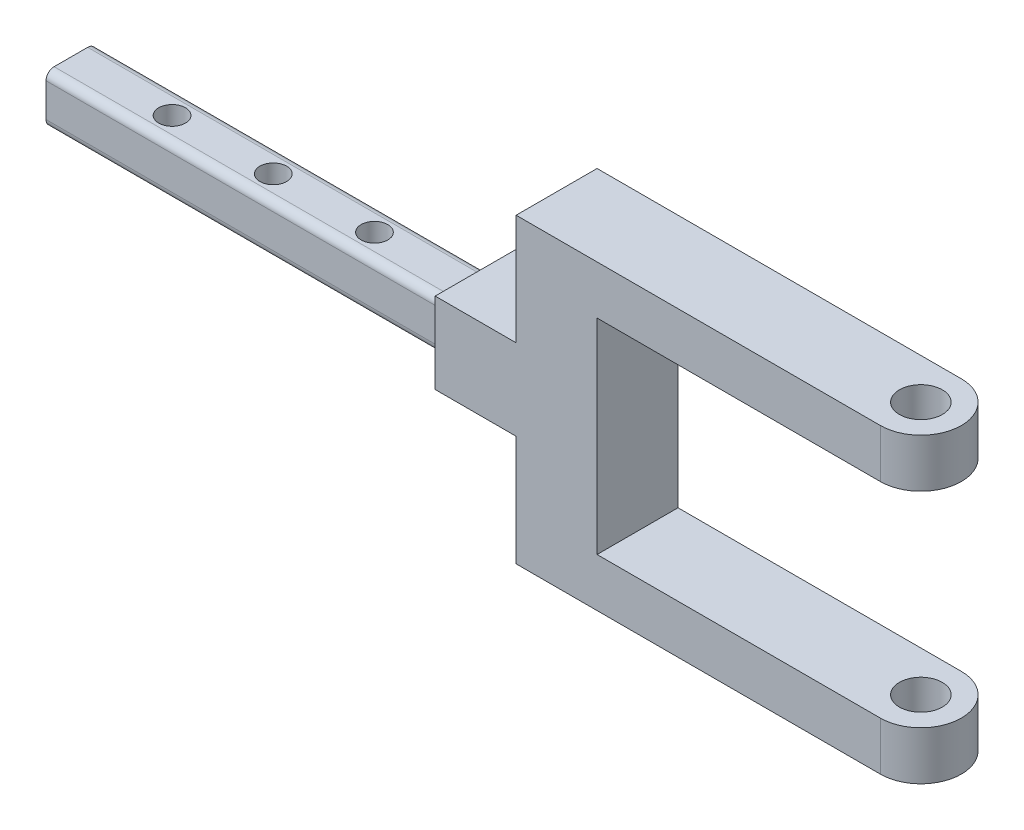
ISO-10303-21;
HEADER;
FILE_DESCRIPTION(('STEP AP214'),'2;1');
FILE_NAME('part.step','',(''),(''),'','','');
FILE_SCHEMA(('AUTOMOTIVE_DESIGN { 1 0 10303 214 1 1 1 1 }'));
ENDSEC;
DATA;
#1=APPLICATION_CONTEXT('core data for automotive mechanical design processes');
#2=APPLICATION_PROTOCOL_DEFINITION('international standard','automotive_design',2000,#1);
#3=PRODUCT_CONTEXT('',#1,'mechanical');
#4=PRODUCT('Part','Part','',(#3));
#5=PRODUCT_RELATED_PRODUCT_CATEGORY('part','',(#4));
#6=PRODUCT_DEFINITION_FORMATION('','',#4);
#7=PRODUCT_DEFINITION_CONTEXT('part definition',#1,'design');
#8=PRODUCT_DEFINITION('design','',#6,#7);
#9=PRODUCT_DEFINITION_SHAPE('','',#8);
#10=(LENGTH_UNIT() NAMED_UNIT(*) SI_UNIT(.MILLI.,.METRE.));
#11=(NAMED_UNIT(*) PLANE_ANGLE_UNIT() SI_UNIT($,.RADIAN.));
#12=(NAMED_UNIT(*) SI_UNIT($,.STERADIAN.) SOLID_ANGLE_UNIT());
#13=UNCERTAINTY_MEASURE_WITH_UNIT(LENGTH_MEASURE(1.E-05),#10,'distance_accuracy_value','');
#14=(GEOMETRIC_REPRESENTATION_CONTEXT(3) GLOBAL_UNCERTAINTY_ASSIGNED_CONTEXT((#13)) GLOBAL_UNIT_ASSIGNED_CONTEXT((#10,
#11,#12)) REPRESENTATION_CONTEXT('',''));
#15=CARTESIAN_POINT('',(0.,0.,0.));
#16=DIRECTION('',(0.,0.,1.));
#17=DIRECTION('',(1.,0.,0.));
#18=AXIS2_PLACEMENT_3D('',#15,#16,#17);
#19=CARTESIAN_POINT('',(40.,18.65,10.));
#20=DIRECTION('',(0.,-1.,0.));
#21=DIRECTION('',(1.,0.,0.));
#22=AXIS2_PLACEMENT_3D('',#19,#20,#21);
#23=PLANE('',#22);
#24=CARTESIAN_POINT('',(35.,18.65,5.));
#25=DIRECTION('',(0.,1.,0.));
#26=DIRECTION('',(-1.,0.,0.));
#27=AXIS2_PLACEMENT_3D('',#24,#25,#26);
#28=CIRCLE('',#27,2.65);
#29=CARTESIAN_POINT('',(32.35,18.65,5.));
#30=VERTEX_POINT('',#29);
#31=EDGE_CURVE('E416',#30,#30,#28,.T.);
#32=ORIENTED_EDGE('',*,*,#31,.F.);
#33=EDGE_LOOP('',(#32));
#34=FACE_BOUND('',#33,.T.);
#35=DIRECTION('',(-1.,0.,0.));
#36=VECTOR('',#35,1.);
#37=CARTESIAN_POINT('',(40.,18.65,10.));
#38=LINE('',#37,#36);
#39=CARTESIAN_POINT('',(35.,18.65,10.));
#40=VERTEX_POINT('',#39);
#41=CARTESIAN_POINT('',(-10.,18.65,10.));
#42=VERTEX_POINT('',#41);
#43=EDGE_CURVE('E269',#40,#42,#38,.T.);
#44=ORIENTED_EDGE('',*,*,#43,.F.);
#45=CARTESIAN_POINT('',(35.,18.65,5.));
#46=DIRECTION('',(0.,1.,0.));
#47=DIRECTION('',(-1.,0.,0.));
#48=AXIS2_PLACEMENT_3D('',#45,#46,#47);
#49=CIRCLE('',#48,5.);
#50=CARTESIAN_POINT('',(35.,18.65,0.));
#51=VERTEX_POINT('',#50);
#52=EDGE_CURVE('E226',#40,#51,#49,.T.);
#53=ORIENTED_EDGE('',*,*,#52,.T.);
#54=DIRECTION('',(-1.,0.,0.));
#55=VECTOR('',#54,1.);
#56=CARTESIAN_POINT('',(40.,18.65,0.));
#57=LINE('',#56,#55);
#58=CARTESIAN_POINT('',(-10.,18.65,0.));
#59=VERTEX_POINT('',#58);
#60=EDGE_CURVE('E255',#51,#59,#57,.T.);
#61=ORIENTED_EDGE('',*,*,#60,.T.);
#62=DIRECTION('',(0.,0.,-1.));
#63=VECTOR('',#62,1.);
#64=CARTESIAN_POINT('',(-10.,18.65,10.));
#65=LINE('',#64,#63);
#66=EDGE_CURVE('E277',#42,#59,#65,.T.);
#67=ORIENTED_EDGE('',*,*,#66,.F.);
#68=EDGE_LOOP('',(#44,#53,#61,#67));
#69=FACE_BOUND('',#68,.T.);
#70=ADVANCED_FACE('F79',(#34,#69),#23,.F.);
#71=CARTESIAN_POINT('',(-10.,-18.65,10.));
#72=DIRECTION('',(0.,1.,0.));
#73=DIRECTION('',(-1.,0.,0.));
#74=AXIS2_PLACEMENT_3D('',#71,#72,#73);
#75=PLANE('',#74);
#76=CARTESIAN_POINT('',(35.,-18.65,5.));
#77=DIRECTION('',(0.,1.,0.));
#78=DIRECTION('',(-1.,0.,0.));
#79=AXIS2_PLACEMENT_3D('',#76,#77,#78);
#80=CIRCLE('',#79,2.65);
#81=CARTESIAN_POINT('',(32.35,-18.65,5.));
#82=VERTEX_POINT('',#81);
#83=EDGE_CURVE('E419',#82,#82,#80,.T.);
#84=ORIENTED_EDGE('',*,*,#83,.T.);
#85=EDGE_LOOP('',(#84));
#86=FACE_BOUND('',#85,.T.);
#87=CARTESIAN_POINT('',(35.,-18.65,5.));
#88=DIRECTION('',(0.,1.,0.));
#89=DIRECTION('',(-1.,0.,0.));
#90=AXIS2_PLACEMENT_3D('',#87,#88,#89);
#91=CIRCLE('',#90,5.);
#92=CARTESIAN_POINT('',(35.,-18.65,10.));
#93=VERTEX_POINT('',#92);
#94=CARTESIAN_POINT('',(35.,-18.65,0.));
#95=VERTEX_POINT('',#94);
#96=EDGE_CURVE('E215',#93,#95,#91,.T.);
#97=ORIENTED_EDGE('',*,*,#96,.F.);
#98=DIRECTION('',(1.,0.,0.));
#99=VECTOR('',#98,1.);
#100=CARTESIAN_POINT('',(-10.,-18.65,10.));
#101=LINE('',#100,#99);
#102=CARTESIAN_POINT('',(-10.,-18.65,10.));
#103=VERTEX_POINT('',#102);
#104=EDGE_CURVE('E220',#103,#93,#101,.T.);
#105=ORIENTED_EDGE('',*,*,#104,.F.);
#106=DIRECTION('',(0.,0.,-1.));
#107=VECTOR('',#106,1.);
#108=CARTESIAN_POINT('',(-10.,-18.65,10.));
#109=LINE('',#108,#107);
#110=CARTESIAN_POINT('',(-10.,-18.65,0.));
#111=VERTEX_POINT('',#110);
#112=EDGE_CURVE('E275',#103,#111,#109,.T.);
#113=ORIENTED_EDGE('',*,*,#112,.T.);
#114=DIRECTION('',(1.,0.,0.));
#115=VECTOR('',#114,1.);
#116=CARTESIAN_POINT('',(-10.,-18.65,0.));
#117=LINE('',#116,#115);
#118=EDGE_CURVE('E222',#111,#95,#117,.T.);
#119=ORIENTED_EDGE('',*,*,#118,.T.);
#120=EDGE_LOOP('',(#97,#105,#113,#119));
#121=FACE_BOUND('',#120,.T.);
#122=ADVANCED_FACE('F217',(#86,#121),#75,.F.);
#123=CARTESIAN_POINT('',(40.,-12.65,10.));
#124=DIRECTION('',(0.,-1.,0.));
#125=DIRECTION('',(1.,0.,0.));
#126=AXIS2_PLACEMENT_3D('',#123,#124,#125);
#127=PLANE('',#126);
#128=CARTESIAN_POINT('',(35.,-12.65,5.));
#129=DIRECTION('',(0.,-1.,0.));
#130=DIRECTION('',(1.,0.,0.));
#131=AXIS2_PLACEMENT_3D('',#128,#129,#130);
#132=CIRCLE('',#131,2.65);
#133=CARTESIAN_POINT('',(37.65,-12.65,5.));
#134=VERTEX_POINT('',#133);
#135=EDGE_CURVE('E286',#134,#134,#132,.T.);
#136=ORIENTED_EDGE('',*,*,#135,.T.);
#137=EDGE_LOOP('',(#136));
#138=FACE_BOUND('',#137,.T.);
#139=DIRECTION('',(-1.,0.,0.));
#140=VECTOR('',#139,1.);
#141=CARTESIAN_POINT('',(40.,-12.65,10.));
#142=LINE('',#141,#140);
#143=CARTESIAN_POINT('',(35.,-12.65,10.));
#144=VERTEX_POINT('',#143);
#145=CARTESIAN_POINT('',(0.,-12.65,10.));
#146=VERTEX_POINT('',#145);
#147=EDGE_CURVE('E241',#144,#146,#142,.T.);
#148=ORIENTED_EDGE('',*,*,#147,.F.);
#149=CARTESIAN_POINT('',(35.,-12.65,5.));
#150=DIRECTION('',(0.,-1.,0.));
#151=DIRECTION('',(1.,0.,0.));
#152=AXIS2_PLACEMENT_3D('',#149,#150,#151);
#153=CIRCLE('',#152,5.);
#154=CARTESIAN_POINT('',(35.,-12.65,0.));
#155=VERTEX_POINT('',#154);
#156=EDGE_CURVE('E232',#155,#144,#153,.T.);
#157=ORIENTED_EDGE('',*,*,#156,.F.);
#158=DIRECTION('',(-1.,0.,0.));
#159=VECTOR('',#158,1.);
#160=CARTESIAN_POINT('',(40.,-12.65,0.));
#161=LINE('',#160,#159);
#162=CARTESIAN_POINT('',(0.,-12.65,0.));
#163=VERTEX_POINT('',#162);
#164=EDGE_CURVE('E262',#155,#163,#161,.T.);
#165=ORIENTED_EDGE('',*,*,#164,.T.);
#166=DIRECTION('',(0.,0.,-1.));
#167=VECTOR('',#166,1.);
#168=CARTESIAN_POINT('',(0.,-12.65,10.));
#169=LINE('',#168,#167);
#170=EDGE_CURVE('E272',#146,#163,#169,.T.);
#171=ORIENTED_EDGE('',*,*,#170,.F.);
#172=EDGE_LOOP('',(#148,#157,#165,#171));
#173=FACE_BOUND('',#172,.T.);
#174=ADVANCED_FACE('F430',(#138,#173),#127,.F.);
#175=CARTESIAN_POINT('',(0.,12.65,10.));
#176=DIRECTION('',(0.,1.,0.));
#177=DIRECTION('',(0.,0.,1.));
#178=AXIS2_PLACEMENT_3D('',#175,#176,#177);
#179=PLANE('',#178);
#180=CARTESIAN_POINT('',(35.,12.65,5.));
#181=DIRECTION('',(0.,1.,0.));
#182=DIRECTION('',(0.,0.,1.));
#183=AXIS2_PLACEMENT_3D('',#180,#181,#182);
#184=CIRCLE('',#183,2.65);
#185=CARTESIAN_POINT('',(35.,12.65,7.65));
#186=VERTEX_POINT('',#185);
#187=EDGE_CURVE('E283',#186,#186,#184,.T.);
#188=ORIENTED_EDGE('',*,*,#187,.T.);
#189=EDGE_LOOP('',(#188));
#190=FACE_BOUND('',#189,.T.);
#191=CARTESIAN_POINT('',(35.,12.65,5.));
#192=DIRECTION('',(0.,1.,0.));
#193=DIRECTION('',(0.,0.,1.));
#194=AXIS2_PLACEMENT_3D('',#191,#192,#193);
#195=CIRCLE('',#194,5.);
#196=CARTESIAN_POINT('',(35.,12.65,10.));
#197=VERTEX_POINT('',#196);
#198=CARTESIAN_POINT('',(35.,12.65,0.));
#199=VERTEX_POINT('',#198);
#200=EDGE_CURVE('E424',#197,#199,#195,.T.);
#201=ORIENTED_EDGE('',*,*,#200,.F.);
#202=DIRECTION('',(1.,0.,0.));
#203=VECTOR('',#202,1.);
#204=CARTESIAN_POINT('',(0.,12.65,10.));
#205=LINE('',#204,#203);
#206=CARTESIAN_POINT('',(0.,12.65,10.));
#207=VERTEX_POINT('',#206);
#208=EDGE_CURVE('E251',#207,#197,#205,.T.);
#209=ORIENTED_EDGE('',*,*,#208,.F.);
#210=DIRECTION('',(0.,0.,-1.));
#211=VECTOR('',#210,1.);
#212=CARTESIAN_POINT('',(0.,12.65,10.));
#213=LINE('',#212,#211);
#214=CARTESIAN_POINT('',(0.,12.65,0.));
#215=VERTEX_POINT('',#214);
#216=EDGE_CURVE('E254',#207,#215,#213,.T.);
#217=ORIENTED_EDGE('',*,*,#216,.T.);
#218=DIRECTION('',(1.,0.,0.));
#219=VECTOR('',#218,1.);
#220=CARTESIAN_POINT('',(0.,12.65,0.));
#221=LINE('',#220,#219);
#222=EDGE_CURVE('E266',#215,#199,#221,.T.);
#223=ORIENTED_EDGE('',*,*,#222,.T.);
#224=EDGE_LOOP('',(#201,#209,#217,#223));
#225=FACE_BOUND('',#224,.T.);
#226=ADVANCED_FACE('F505',(#190,#225),#179,.F.);
#227=CARTESIAN_POINT('',(0.,0.,10.));
#228=DIRECTION('',(0.,0.,1.));
#229=DIRECTION('',(1.,0.,0.));
#230=AXIS2_PLACEMENT_3D('',#227,#228,#229);
#231=PLANE('',#230);
#232=ORIENTED_EDGE('',*,*,#104,.T.);
#233=DIRECTION('',(0.,1.,0.));
#234=VECTOR('',#233,1.);
#235=CARTESIAN_POINT('',(35.,-18.65,10.));
#236=LINE('',#235,#234);
#237=EDGE_CURVE('E229',#93,#144,#236,.T.);
#238=ORIENTED_EDGE('',*,*,#237,.T.);
#239=ORIENTED_EDGE('',*,*,#147,.T.);
#240=DIRECTION('',(0.,1.,0.));
#241=VECTOR('',#240,1.);
#242=CARTESIAN_POINT('',(0.,12.65,10.));
#243=LINE('',#242,#241);
#244=EDGE_CURVE('E244',#146,#207,#243,.T.);
#245=ORIENTED_EDGE('',*,*,#244,.T.);
#246=ORIENTED_EDGE('',*,*,#208,.T.);
#247=DIRECTION('',(0.,1.,0.));
#248=VECTOR('',#247,1.);
#249=CARTESIAN_POINT('',(35.,-18.65,10.));
#250=LINE('',#249,#248);
#251=EDGE_CURVE('E282',#197,#40,#250,.T.);
#252=ORIENTED_EDGE('',*,*,#251,.T.);
#253=ORIENTED_EDGE('',*,*,#43,.T.);
#254=DIRECTION('',(0.,-1.,0.));
#255=VECTOR('',#254,1.);
#256=CARTESIAN_POINT('',(-10.,18.65,10.));
#257=LINE('',#256,#255);
#258=CARTESIAN_POINT('',(-10.,5.,10.));
#259=VERTEX_POINT('',#258);
#260=EDGE_CURVE('E242',#42,#259,#257,.T.);
#261=ORIENTED_EDGE('',*,*,#260,.T.);
#262=DIRECTION('',(1.,0.,0.));
#263=VECTOR('',#262,1.);
#264=CARTESIAN_POINT('',(-20.,5.,10.));
#265=LINE('',#264,#263);
#266=CARTESIAN_POINT('',(-20.,5.,10.));
#267=VERTEX_POINT('',#266);
#268=EDGE_CURVE('E380',#267,#259,#265,.T.);
#269=ORIENTED_EDGE('',*,*,#268,.F.);
#270=DIRECTION('',(0.,1.,0.));
#271=VECTOR('',#270,1.);
#272=CARTESIAN_POINT('',(-20.,0.,10.));
#273=LINE('',#272,#271);
#274=CARTESIAN_POINT('',(-20.,-5.,10.));
#275=VERTEX_POINT('',#274);
#276=EDGE_CURVE('E369',#275,#267,#273,.T.);
#277=ORIENTED_EDGE('',*,*,#276,.F.);
#278=DIRECTION('',(1.,0.,0.));
#279=VECTOR('',#278,1.);
#280=CARTESIAN_POINT('',(-20.,-5.,10.));
#281=LINE('',#280,#279);
#282=CARTESIAN_POINT('',(-10.,-5.,10.));
#283=VERTEX_POINT('',#282);
#284=EDGE_CURVE('E383',#275,#283,#281,.T.);
#285=ORIENTED_EDGE('',*,*,#284,.T.);
#286=EDGE_CURVE('E239',#283,#103,#257,.T.);
#287=ORIENTED_EDGE('',*,*,#286,.T.);
#288=EDGE_LOOP('',(#232,#238,#239,#245,#246,#252,#253,#261,#269,#277,#285,#287));
#289=FACE_BOUND('',#288,.T.);
#290=ADVANCED_FACE('F237',(#289),#231,.T.);
#291=CARTESIAN_POINT('',(0.,0.,0.));
#292=DIRECTION('',(0.,0.,1.));
#293=DIRECTION('',(1.,0.,0.));
#294=AXIS2_PLACEMENT_3D('',#291,#292,#293);
#295=PLANE('',#294);
#296=DIRECTION('',(0.,1.,0.));
#297=VECTOR('',#296,1.);
#298=CARTESIAN_POINT('',(35.,-18.65,0.));
#299=LINE('',#298,#297);
#300=EDGE_CURVE('E225',#95,#155,#299,.T.);
#301=ORIENTED_EDGE('',*,*,#300,.F.);
#302=ORIENTED_EDGE('',*,*,#118,.F.);
#303=DIRECTION('',(0.,-1.,0.));
#304=VECTOR('',#303,1.);
#305=CARTESIAN_POINT('',(-10.,18.65,0.));
#306=LINE('',#305,#304);
#307=CARTESIAN_POINT('',(-10.,-5.,0.));
#308=VERTEX_POINT('',#307);
#309=EDGE_CURVE('E257',#308,#111,#306,.T.);
#310=ORIENTED_EDGE('',*,*,#309,.F.);
#311=DIRECTION('',(1.,0.,0.));
#312=VECTOR('',#311,1.);
#313=CARTESIAN_POINT('',(-20.,-5.,0.));
#314=LINE('',#313,#312);
#315=CARTESIAN_POINT('',(-20.,-5.,0.));
#316=VERTEX_POINT('',#315);
#317=EDGE_CURVE('E258',#316,#308,#314,.T.);
#318=ORIENTED_EDGE('',*,*,#317,.F.);
#319=DIRECTION('',(0.,-1.,0.));
#320=VECTOR('',#319,1.);
#321=CARTESIAN_POINT('',(-20.,0.,0.));
#322=LINE('',#321,#320);
#323=CARTESIAN_POINT('',(-20.,5.,0.));
#324=VERTEX_POINT('',#323);
#325=EDGE_CURVE('E363',#324,#316,#322,.T.);
#326=ORIENTED_EDGE('',*,*,#325,.F.);
#327=DIRECTION('',(1.,0.,0.));
#328=VECTOR('',#327,1.);
#329=CARTESIAN_POINT('',(-20.,5.,0.));
#330=LINE('',#329,#328);
#331=CARTESIAN_POINT('',(-10.,5.,0.));
#332=VERTEX_POINT('',#331);
#333=EDGE_CURVE('E374',#324,#332,#330,.T.);
#334=ORIENTED_EDGE('',*,*,#333,.T.);
#335=EDGE_CURVE('E259',#59,#332,#306,.T.);
#336=ORIENTED_EDGE('',*,*,#335,.F.);
#337=ORIENTED_EDGE('',*,*,#60,.F.);
#338=DIRECTION('',(0.,1.,0.));
#339=VECTOR('',#338,1.);
#340=CARTESIAN_POINT('',(35.,-18.65,0.));
#341=LINE('',#340,#339);
#342=EDGE_CURVE('E280',#199,#51,#341,.T.);
#343=ORIENTED_EDGE('',*,*,#342,.F.);
#344=ORIENTED_EDGE('',*,*,#222,.F.);
#345=DIRECTION('',(0.,1.,0.));
#346=VECTOR('',#345,1.);
#347=CARTESIAN_POINT('',(0.,12.65,0.));
#348=LINE('',#347,#346);
#349=EDGE_CURVE('E264',#163,#215,#348,.T.);
#350=ORIENTED_EDGE('',*,*,#349,.F.);
#351=ORIENTED_EDGE('',*,*,#164,.F.);
#352=EDGE_LOOP('',(#301,#302,#310,#318,#326,#334,#336,#337,#343,#344,#350,#351));
#353=FACE_BOUND('',#352,.T.);
#354=ADVANCED_FACE('F400',(#353),#295,.F.);
#355=CARTESIAN_POINT('',(-20.,0.,0.));
#356=DIRECTION('',(-1.,0.,0.));
#357=DIRECTION('',(0.,-1.,0.));
#358=AXIS2_PLACEMENT_3D('',#355,#356,#357);
#359=PLANE('',#358);
#360=ORIENTED_EDGE('',*,*,#325,.T.);
#361=DIRECTION('',(0.,0.,1.));
#362=VECTOR('',#361,1.);
#363=CARTESIAN_POINT('',(-20.,-5.,0.));
#364=LINE('',#363,#362);
#365=EDGE_CURVE('E366',#316,#275,#364,.T.);
#366=ORIENTED_EDGE('',*,*,#365,.T.);
#367=ORIENTED_EDGE('',*,*,#276,.T.);
#368=DIRECTION('',(0.,0.,1.));
#369=VECTOR('',#368,1.);
#370=CARTESIAN_POINT('',(-20.,5.,0.));
#371=LINE('',#370,#369);
#372=EDGE_CURVE('E371',#324,#267,#371,.T.);
#373=ORIENTED_EDGE('',*,*,#372,.F.);
#374=EDGE_LOOP('',(#360,#366,#367,#373));
#375=FACE_BOUND('',#374,.T.);
#376=DIRECTION('',(0.,1.,0.));
#377=VECTOR('',#376,1.);
#378=CARTESIAN_POINT('',(-20.,0.,8.075));
#379=LINE('',#378,#377);
#380=CARTESIAN_POINT('',(-20.,-2.075,8.075));
#381=VERTEX_POINT('',#380);
#382=CARTESIAN_POINT('',(-20.,2.075,8.075));
#383=VERTEX_POINT('',#382);
#384=EDGE_CURVE('E334',#381,#383,#379,.T.);
#385=ORIENTED_EDGE('',*,*,#384,.F.);
#386=CARTESIAN_POINT('',(-20.,-2.075,7.075));
#387=DIRECTION('',(-1.,0.,0.));
#388=DIRECTION('',(0.,-1.,0.));
#389=AXIS2_PLACEMENT_3D('',#386,#387,#388);
#390=CIRCLE('',#389,1.);
#391=CARTESIAN_POINT('',(-20.,-3.075,7.075));
#392=VERTEX_POINT('',#391);
#393=EDGE_CURVE('E87',#381,#392,#390,.F.);
#394=ORIENTED_EDGE('',*,*,#393,.T.);
#395=DIRECTION('',(0.,0.,-1.));
#396=VECTOR('',#395,1.);
#397=CARTESIAN_POINT('',(-20.,-3.075,0.));
#398=LINE('',#397,#396);
#399=CARTESIAN_POINT('',(-20.,-3.075,2.925));
#400=VERTEX_POINT('',#399);
#401=EDGE_CURVE('E358',#392,#400,#398,.T.);
#402=ORIENTED_EDGE('',*,*,#401,.T.);
#403=CARTESIAN_POINT('',(-20.,-2.075,2.925));
#404=DIRECTION('',(-1.,0.,0.));
#405=DIRECTION('',(0.,-1.,0.));
#406=AXIS2_PLACEMENT_3D('',#403,#404,#405);
#407=CIRCLE('',#406,1.);
#408=CARTESIAN_POINT('',(-20.,-2.075,1.925));
#409=VERTEX_POINT('',#408);
#410=EDGE_CURVE('E12',#400,#409,#407,.F.);
#411=ORIENTED_EDGE('',*,*,#410,.T.);
#412=DIRECTION('',(0.,1.,0.));
#413=VECTOR('',#412,1.);
#414=CARTESIAN_POINT('',(-20.,0.,1.925));
#415=LINE('',#414,#413);
#416=CARTESIAN_POINT('',(-20.,2.075,1.925));
#417=VERTEX_POINT('',#416);
#418=EDGE_CURVE('E325',#409,#417,#415,.T.);
#419=ORIENTED_EDGE('',*,*,#418,.T.);
#420=CARTESIAN_POINT('',(-20.,2.075,2.925));
#421=DIRECTION('',(-1.,0.,0.));
#422=DIRECTION('',(0.,-1.,0.));
#423=AXIS2_PLACEMENT_3D('',#420,#421,#422);
#424=CIRCLE('',#423,1.);
#425=CARTESIAN_POINT('',(-20.,3.075,2.925));
#426=VERTEX_POINT('',#425);
#427=EDGE_CURVE('E318',#417,#426,#424,.F.);
#428=ORIENTED_EDGE('',*,*,#427,.T.);
#429=DIRECTION('',(0.,0.,-1.));
#430=VECTOR('',#429,1.);
#431=CARTESIAN_POINT('',(-20.,3.075,0.));
#432=LINE('',#431,#430);
#433=CARTESIAN_POINT('',(-20.,3.075,7.075));
#434=VERTEX_POINT('',#433);
#435=EDGE_CURVE('E323',#434,#426,#432,.T.);
#436=ORIENTED_EDGE('',*,*,#435,.F.);
#437=CARTESIAN_POINT('',(-20.,2.075,7.075));
#438=DIRECTION('',(-1.,0.,0.));
#439=DIRECTION('',(0.,-1.,0.));
#440=AXIS2_PLACEMENT_3D('',#437,#438,#439);
#441=CIRCLE('',#440,1.);
#442=EDGE_CURVE('E316',#434,#383,#441,.F.);
#443=ORIENTED_EDGE('',*,*,#442,.T.);
#444=EDGE_LOOP('',(#385,#394,#402,#411,#419,#428,#436,#443));
#445=FACE_BOUND('',#444,.T.);
#446=ADVANCED_FACE('F322',(#375,#445),#359,.T.);
#447=CARTESIAN_POINT('',(-10.,18.65,10.));
#448=DIRECTION('',(1.,0.,0.));
#449=DIRECTION('',(0.,1.,0.));
#450=AXIS2_PLACEMENT_3D('',#447,#448,#449);
#451=PLANE('',#450);
#452=DIRECTION('',(0.,0.,1.));
#453=VECTOR('',#452,1.);
#454=CARTESIAN_POINT('',(-10.,-5.,0.));
#455=LINE('',#454,#453);
#456=EDGE_CURVE('E357',#308,#283,#455,.T.);
#457=ORIENTED_EDGE('',*,*,#456,.F.);
#458=ORIENTED_EDGE('',*,*,#309,.T.);
#459=ORIENTED_EDGE('',*,*,#112,.F.);
#460=ORIENTED_EDGE('',*,*,#286,.F.);
#461=EDGE_LOOP('',(#457,#458,#459,#460));
#462=FACE_BOUND('',#461,.T.);
#463=ADVANCED_FACE('F413',(#462),#451,.F.);
#464=ORIENTED_EDGE('',*,*,#335,.T.);
#465=DIRECTION('',(0.,0.,1.));
#466=VECTOR('',#465,1.);
#467=CARTESIAN_POINT('',(-10.,5.,0.));
#468=LINE('',#467,#466);
#469=EDGE_CURVE('E367',#332,#259,#468,.T.);
#470=ORIENTED_EDGE('',*,*,#469,.T.);
#471=ORIENTED_EDGE('',*,*,#260,.F.);
#472=ORIENTED_EDGE('',*,*,#66,.T.);
#473=EDGE_LOOP('',(#464,#470,#471,#472));
#474=FACE_BOUND('',#473,.T.);
#475=ADVANCED_FACE('F394',(#474),#451,.F.);
#476=CARTESIAN_POINT('',(0.,12.65,10.));
#477=DIRECTION('',(-1.,0.,0.));
#478=DIRECTION('',(0.,0.,1.));
#479=AXIS2_PLACEMENT_3D('',#476,#477,#478);
#480=PLANE('',#479);
#481=ORIENTED_EDGE('',*,*,#349,.T.);
#482=ORIENTED_EDGE('',*,*,#216,.F.);
#483=ORIENTED_EDGE('',*,*,#244,.F.);
#484=ORIENTED_EDGE('',*,*,#170,.T.);
#485=EDGE_LOOP('',(#481,#482,#483,#484));
#486=FACE_BOUND('',#485,.T.);
#487=ADVANCED_FACE('F502',(#486),#480,.F.);
#488=CARTESIAN_POINT('',(-20.,-5.,0.));
#489=DIRECTION('',(0.,1.,0.));
#490=DIRECTION('',(-1.,0.,0.));
#491=AXIS2_PLACEMENT_3D('',#488,#489,#490);
#492=PLANE('',#491);
#493=ORIENTED_EDGE('',*,*,#456,.T.);
#494=ORIENTED_EDGE('',*,*,#284,.F.);
#495=ORIENTED_EDGE('',*,*,#365,.F.);
#496=ORIENTED_EDGE('',*,*,#317,.T.);
#497=EDGE_LOOP('',(#493,#494,#495,#496));
#498=FACE_BOUND('',#497,.T.);
#499=ADVANCED_FACE('F410',(#498),#492,.F.);
#500=CARTESIAN_POINT('',(-20.,5.,0.));
#501=DIRECTION('',(0.,1.,0.));
#502=DIRECTION('',(-1.,0.,0.));
#503=AXIS2_PLACEMENT_3D('',#500,#501,#502);
#504=PLANE('',#503);
#505=ORIENTED_EDGE('',*,*,#469,.F.);
#506=ORIENTED_EDGE('',*,*,#333,.F.);
#507=ORIENTED_EDGE('',*,*,#372,.T.);
#508=ORIENTED_EDGE('',*,*,#268,.T.);
#509=EDGE_LOOP('',(#505,#506,#507,#508));
#510=FACE_BOUND('',#509,.T.);
#511=ADVANCED_FACE('F405',(#510),#504,.T.);
#512=CARTESIAN_POINT('',(-70.,-3.07500000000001,0.));
#513=DIRECTION('',(0.,-1.,0.));
#514=DIRECTION('',(1.,0.,0.));
#515=AXIS2_PLACEMENT_3D('',#512,#513,#514);
#516=PLANE('',#515);
#517=CARTESIAN_POINT('',(-32.5,-3.07500000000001,5.));
#518=DIRECTION('',(0.,-1.,0.));
#519=DIRECTION('',(1.,0.,0.));
#520=AXIS2_PLACEMENT_3D('',#517,#518,#519);
#521=CIRCLE('',#520,1.65);
#522=CARTESIAN_POINT('',(-30.85,-3.07500000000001,5.));
#523=VERTEX_POINT('',#522);
#524=EDGE_CURVE('E235',#523,#523,#521,.T.);
#525=ORIENTED_EDGE('',*,*,#524,.F.);
#526=EDGE_LOOP('',(#525));
#527=FACE_BOUND('',#526,.T.);
#528=CARTESIAN_POINT('',(-57.5,-3.07500000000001,5.00000000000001));
#529=DIRECTION('',(0.,-1.,0.));
#530=DIRECTION('',(1.,0.,0.));
#531=AXIS2_PLACEMENT_3D('',#528,#529,#530);
#532=CIRCLE('',#531,1.65);
#533=CARTESIAN_POINT('',(-55.85,-3.07500000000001,5.00000000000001));
#534=VERTEX_POINT('',#533);
#535=EDGE_CURVE('E709',#534,#534,#532,.T.);
#536=ORIENTED_EDGE('',*,*,#535,.F.);
#537=EDGE_LOOP('',(#536));
#538=FACE_BOUND('',#537,.T.);
#539=CARTESIAN_POINT('',(-45.,-3.07500000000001,5.));
#540=DIRECTION('',(0.,-1.,0.));
#541=DIRECTION('',(1.,0.,0.));
#542=AXIS2_PLACEMENT_3D('',#539,#540,#541);
#543=CIRCLE('',#542,1.65);
#544=CARTESIAN_POINT('',(-43.35,-3.07500000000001,5.));
#545=VERTEX_POINT('',#544);
#546=EDGE_CURVE('E718',#545,#545,#543,.T.);
#547=ORIENTED_EDGE('',*,*,#546,.F.);
#548=EDGE_LOOP('',(#547));
#549=FACE_BOUND('',#548,.T.);
#550=ORIENTED_EDGE('',*,*,#401,.F.);
#551=DIRECTION('',(1.,0.,0.));
#552=VECTOR('',#551,1.);
#553=CARTESIAN_POINT('',(-70.,-3.07500000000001,7.075));
#554=LINE('',#553,#552);
#555=CARTESIAN_POINT('',(-70.,-3.07500000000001,7.075));
#556=VERTEX_POINT('',#555);
#557=EDGE_CURVE('E314',#392,#556,#554,.F.);
#558=ORIENTED_EDGE('',*,*,#557,.T.);
#559=DIRECTION('',(0.,0.,-1.));
#560=VECTOR('',#559,1.);
#561=CARTESIAN_POINT('',(-70.,-3.07500000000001,0.));
#562=LINE('',#561,#560);
#563=CARTESIAN_POINT('',(-70.,-3.07500000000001,2.925));
#564=VERTEX_POINT('',#563);
#565=EDGE_CURVE('E348',#556,#564,#562,.T.);
#566=ORIENTED_EDGE('',*,*,#565,.T.);
#567=DIRECTION('',(1.,0.,0.));
#568=VECTOR('',#567,1.);
#569=CARTESIAN_POINT('',(-70.,-3.07500000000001,2.925));
#570=LINE('',#569,#568);
#571=EDGE_CURVE('E312',#564,#400,#570,.T.);
#572=ORIENTED_EDGE('',*,*,#571,.T.);
#573=EDGE_LOOP('',(#550,#558,#566,#572));
#574=FACE_BOUND('',#573,.T.);
#575=ADVANCED_FACE('F483',(#527,#538,#549,#574),#516,.T.);
#576=CARTESIAN_POINT('',(-70.,0.,8.075));
#577=DIRECTION('',(0.,0.,-1.));
#578=DIRECTION('',(0.,1.,0.));
#579=AXIS2_PLACEMENT_3D('',#576,#577,#578);
#580=PLANE('',#579);
#581=ORIENTED_EDGE('',*,*,#384,.T.);
#582=DIRECTION('',(1.,0.,0.));
#583=VECTOR('',#582,1.);
#584=CARTESIAN_POINT('',(-70.,2.07499999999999,8.075));
#585=LINE('',#584,#583);
#586=CARTESIAN_POINT('',(-70.,2.07499999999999,8.075));
#587=VERTEX_POINT('',#586);
#588=EDGE_CURVE('E297',#383,#587,#585,.F.);
#589=ORIENTED_EDGE('',*,*,#588,.T.);
#590=DIRECTION('',(0.,1.,0.));
#591=VECTOR('',#590,1.);
#592=CARTESIAN_POINT('',(-70.,0.,8.075));
#593=LINE('',#592,#591);
#594=CARTESIAN_POINT('',(-70.,-2.07500000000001,8.075));
#595=VERTEX_POINT('',#594);
#596=EDGE_CURVE('E350',#595,#587,#593,.T.);
#597=ORIENTED_EDGE('',*,*,#596,.F.);
#598=DIRECTION('',(1.,0.,0.));
#599=VECTOR('',#598,1.);
#600=CARTESIAN_POINT('',(-20.,-2.075,8.075));
#601=LINE('',#600,#599);
#602=EDGE_CURVE('E294',#595,#381,#601,.T.);
#603=ORIENTED_EDGE('',*,*,#602,.T.);
#604=EDGE_LOOP('',(#581,#589,#597,#603));
#605=FACE_BOUND('',#604,.T.);
#606=ADVANCED_FACE('F480',(#605),#580,.F.);
#607=CARTESIAN_POINT('',(-70.,3.07499999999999,0.));
#608=DIRECTION('',(0.,-1.,0.));
#609=DIRECTION('',(1.,0.,0.));
#610=AXIS2_PLACEMENT_3D('',#607,#608,#609);
#611=PLANE('',#610);
#612=CARTESIAN_POINT('',(-32.5,3.07499999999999,5.));
#613=DIRECTION('',(0.,1.,0.));
#614=DIRECTION('',(-1.,0.,0.));
#615=AXIS2_PLACEMENT_3D('',#612,#613,#614);
#616=CIRCLE('',#615,1.65);
#617=CARTESIAN_POINT('',(-34.15,3.07499999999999,5.));
#618=VERTEX_POINT('',#617);
#619=EDGE_CURVE('E715',#618,#618,#616,.T.);
#620=ORIENTED_EDGE('',*,*,#619,.F.);
#621=EDGE_LOOP('',(#620));
#622=FACE_BOUND('',#621,.T.);
#623=CARTESIAN_POINT('',(-57.5,3.07499999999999,5.00000000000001));
#624=DIRECTION('',(0.,1.,0.));
#625=DIRECTION('',(-1.,0.,0.));
#626=AXIS2_PLACEMENT_3D('',#623,#624,#625);
#627=CIRCLE('',#626,1.65);
#628=CARTESIAN_POINT('',(-59.15,3.07499999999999,5.00000000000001));
#629=VERTEX_POINT('',#628);
#630=EDGE_CURVE('E712',#629,#629,#627,.T.);
#631=ORIENTED_EDGE('',*,*,#630,.F.);
#632=EDGE_LOOP('',(#631));
#633=FACE_BOUND('',#632,.T.);
#634=CARTESIAN_POINT('',(-45.,3.07499999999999,5.));
#635=DIRECTION('',(0.,1.,0.));
#636=DIRECTION('',(-1.,0.,0.));
#637=AXIS2_PLACEMENT_3D('',#634,#635,#636);
#638=CIRCLE('',#637,1.65);
#639=CARTESIAN_POINT('',(-46.65,3.07499999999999,5.));
#640=VERTEX_POINT('',#639);
#641=EDGE_CURVE('E714',#640,#640,#638,.T.);
#642=ORIENTED_EDGE('',*,*,#641,.F.);
#643=EDGE_LOOP('',(#642));
#644=FACE_BOUND('',#643,.T.);
#645=DIRECTION('',(0.,0.,-1.));
#646=VECTOR('',#645,1.);
#647=CARTESIAN_POINT('',(-70.,3.07499999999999,0.));
#648=LINE('',#647,#646);
#649=CARTESIAN_POINT('',(-70.,3.07499999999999,7.075));
#650=VERTEX_POINT('',#649);
#651=CARTESIAN_POINT('',(-70.,3.07499999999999,2.925));
#652=VERTEX_POINT('',#651);
#653=EDGE_CURVE('E345',#650,#652,#648,.T.);
#654=ORIENTED_EDGE('',*,*,#653,.F.);
#655=DIRECTION('',(1.,0.,0.));
#656=VECTOR('',#655,1.);
#657=CARTESIAN_POINT('',(-70.,3.07499999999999,7.075));
#658=LINE('',#657,#656);
#659=EDGE_CURVE('E291',#650,#434,#658,.T.);
#660=ORIENTED_EDGE('',*,*,#659,.T.);
#661=ORIENTED_EDGE('',*,*,#435,.T.);
#662=DIRECTION('',(1.,0.,0.));
#663=VECTOR('',#662,1.);
#664=CARTESIAN_POINT('',(-70.,3.07499999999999,2.925));
#665=LINE('',#664,#663);
#666=EDGE_CURVE('E289',#426,#652,#665,.F.);
#667=ORIENTED_EDGE('',*,*,#666,.T.);
#668=EDGE_LOOP('',(#654,#660,#661,#667));
#669=FACE_BOUND('',#668,.T.);
#670=ADVANCED_FACE('F331',(#622,#633,#644,#669),#611,.F.);
#671=CARTESIAN_POINT('',(-70.,0.,1.925));
#672=DIRECTION('',(0.,0.,-1.));
#673=DIRECTION('',(0.,1.,0.));
#674=AXIS2_PLACEMENT_3D('',#671,#672,#673);
#675=PLANE('',#674);
#676=DIRECTION('',(0.,1.,0.));
#677=VECTOR('',#676,1.);
#678=CARTESIAN_POINT('',(-70.,0.,1.925));
#679=LINE('',#678,#677);
#680=CARTESIAN_POINT('',(-70.,-2.07500000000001,1.925));
#681=VERTEX_POINT('',#680);
#682=CARTESIAN_POINT('',(-70.,2.07499999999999,1.925));
#683=VERTEX_POINT('',#682);
#684=EDGE_CURVE('E343',#681,#683,#679,.T.);
#685=ORIENTED_EDGE('',*,*,#684,.T.);
#686=DIRECTION('',(1.,0.,0.));
#687=VECTOR('',#686,1.);
#688=CARTESIAN_POINT('',(-20.,2.075,1.925));
#689=LINE('',#688,#687);
#690=EDGE_CURVE('E309',#683,#417,#689,.T.);
#691=ORIENTED_EDGE('',*,*,#690,.T.);
#692=ORIENTED_EDGE('',*,*,#418,.F.);
#693=DIRECTION('',(1.,0.,0.));
#694=VECTOR('',#693,1.);
#695=CARTESIAN_POINT('',(-70.,-2.07500000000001,1.925));
#696=LINE('',#695,#694);
#697=EDGE_CURVE('E307',#409,#681,#696,.F.);
#698=ORIENTED_EDGE('',*,*,#697,.T.);
#699=EDGE_LOOP('',(#685,#691,#692,#698));
#700=FACE_BOUND('',#699,.T.);
#701=ADVANCED_FACE('F347',(#700),#675,.T.);
#702=CARTESIAN_POINT('',(-70.,0.,0.));
#703=DIRECTION('',(1.,0.,0.));
#704=DIRECTION('',(0.,1.,0.));
#705=AXIS2_PLACEMENT_3D('',#702,#703,#704);
#706=PLANE('',#705);
#707=ORIENTED_EDGE('',*,*,#596,.T.);
#708=CARTESIAN_POINT('',(-70.,2.07499999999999,7.075));
#709=DIRECTION('',(1.,0.,0.));
#710=DIRECTION('',(0.,1.,0.));
#711=AXIS2_PLACEMENT_3D('',#708,#709,#710);
#712=CIRCLE('',#711,1.);
#713=EDGE_CURVE('E305',#587,#650,#712,.F.);
#714=ORIENTED_EDGE('',*,*,#713,.T.);
#715=ORIENTED_EDGE('',*,*,#653,.T.);
#716=CARTESIAN_POINT('',(-70.,2.07499999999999,2.925));
#717=DIRECTION('',(1.,0.,0.));
#718=DIRECTION('',(0.,1.,0.));
#719=AXIS2_PLACEMENT_3D('',#716,#717,#718);
#720=CIRCLE('',#719,1.);
#721=EDGE_CURVE('E303',#652,#683,#720,.F.);
#722=ORIENTED_EDGE('',*,*,#721,.T.);
#723=ORIENTED_EDGE('',*,*,#684,.F.);
#724=CARTESIAN_POINT('',(-70.,-2.07500000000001,2.925));
#725=DIRECTION('',(1.,0.,0.));
#726=DIRECTION('',(0.,1.,0.));
#727=AXIS2_PLACEMENT_3D('',#724,#725,#726);
#728=CIRCLE('',#727,1.);
#729=EDGE_CURVE('E299',#681,#564,#728,.F.);
#730=ORIENTED_EDGE('',*,*,#729,.T.);
#731=ORIENTED_EDGE('',*,*,#565,.F.);
#732=CARTESIAN_POINT('',(-70.,-2.07500000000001,7.075));
#733=DIRECTION('',(1.,0.,0.));
#734=DIRECTION('',(0.,1.,0.));
#735=AXIS2_PLACEMENT_3D('',#732,#733,#734);
#736=CIRCLE('',#735,1.);
#737=EDGE_CURVE('E301',#556,#595,#736,.F.);
#738=ORIENTED_EDGE('',*,*,#737,.T.);
#739=EDGE_LOOP('',(#707,#714,#715,#722,#723,#730,#731,#738));
#740=FACE_BOUND('',#739,.T.);
#741=ADVANCED_FACE('F342',(#740),#706,.F.);
#742=CARTESIAN_POINT('',(35.,-18.65,5.));
#743=DIRECTION('',(0.,1.,0.));
#744=DIRECTION('',(-1.,0.,0.));
#745=AXIS2_PLACEMENT_3D('',#742,#743,#744);
#746=CYLINDRICAL_SURFACE('',#745,5.);
#747=ORIENTED_EDGE('',*,*,#200,.T.);
#748=ORIENTED_EDGE('',*,*,#342,.T.);
#749=ORIENTED_EDGE('',*,*,#52,.F.);
#750=ORIENTED_EDGE('',*,*,#251,.F.);
#751=EDGE_LOOP('',(#747,#748,#749,#750));
#752=FACE_BOUND('',#751,.T.);
#753=ADVANCED_FACE('F588',(#752),#746,.T.);
#754=ORIENTED_EDGE('',*,*,#156,.T.);
#755=ORIENTED_EDGE('',*,*,#237,.F.);
#756=ORIENTED_EDGE('',*,*,#96,.T.);
#757=ORIENTED_EDGE('',*,*,#300,.T.);
#758=EDGE_LOOP('',(#754,#755,#756,#757));
#759=FACE_BOUND('',#758,.T.);
#760=ADVANCED_FACE('F230',(#759),#746,.T.);
#761=CARTESIAN_POINT('',(35.,-18.65,5.));
#762=DIRECTION('',(0.,1.,0.));
#763=DIRECTION('',(-1.,0.,0.));
#764=AXIS2_PLACEMENT_3D('',#761,#762,#763);
#765=CYLINDRICAL_SURFACE('',#764,2.65);
#766=ORIENTED_EDGE('',*,*,#31,.T.);
#767=EDGE_LOOP('',(#766));
#768=FACE_BOUND('',#767,.T.);
#769=ORIENTED_EDGE('',*,*,#187,.F.);
#770=EDGE_LOOP('',(#769));
#771=FACE_BOUND('',#770,.T.);
#772=ADVANCED_FACE('F436',(#768,#771),#765,.F.);
#773=ORIENTED_EDGE('',*,*,#83,.F.);
#774=EDGE_LOOP('',(#773));
#775=FACE_BOUND('',#774,.T.);
#776=ORIENTED_EDGE('',*,*,#135,.F.);
#777=EDGE_LOOP('',(#776));
#778=FACE_BOUND('',#777,.T.);
#779=ADVANCED_FACE('F433',(#775,#778),#765,.F.);
#780=CARTESIAN_POINT('',(-45.,-18.65,5.));
#781=DIRECTION('',(0.,1.,0.));
#782=DIRECTION('',(-1.,0.,0.));
#783=AXIS2_PLACEMENT_3D('',#780,#781,#782);
#784=CYLINDRICAL_SURFACE('',#783,1.65);
#785=ORIENTED_EDGE('',*,*,#546,.T.);
#786=EDGE_LOOP('',(#785));
#787=FACE_BOUND('',#786,.T.);
#788=ORIENTED_EDGE('',*,*,#641,.T.);
#789=EDGE_LOOP('',(#788));
#790=FACE_BOUND('',#789,.T.);
#791=ADVANCED_FACE('F435',(#787,#790),#784,.F.);
#792=CARTESIAN_POINT('',(-57.5,-18.65,5.00000000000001));
#793=DIRECTION('',(0.,1.,0.));
#794=DIRECTION('',(-1.,0.,0.));
#795=AXIS2_PLACEMENT_3D('',#792,#793,#794);
#796=CYLINDRICAL_SURFACE('',#795,1.65);
#797=ORIENTED_EDGE('',*,*,#535,.T.);
#798=EDGE_LOOP('',(#797));
#799=FACE_BOUND('',#798,.T.);
#800=ORIENTED_EDGE('',*,*,#630,.T.);
#801=EDGE_LOOP('',(#800));
#802=FACE_BOUND('',#801,.T.);
#803=ADVANCED_FACE('F443',(#799,#802),#796,.F.);
#804=CARTESIAN_POINT('',(-32.5,-18.65,5.));
#805=DIRECTION('',(0.,1.,0.));
#806=DIRECTION('',(-1.,0.,0.));
#807=AXIS2_PLACEMENT_3D('',#804,#805,#806);
#808=CYLINDRICAL_SURFACE('',#807,1.65);
#809=ORIENTED_EDGE('',*,*,#524,.T.);
#810=EDGE_LOOP('',(#809));
#811=FACE_BOUND('',#810,.T.);
#812=ORIENTED_EDGE('',*,*,#619,.T.);
#813=EDGE_LOOP('',(#812));
#814=FACE_BOUND('',#813,.T.);
#815=ADVANCED_FACE('F464',(#811,#814),#808,.F.);
#816=CARTESIAN_POINT('',(-70.,2.07499999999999,7.075));
#817=DIRECTION('',(1.,0.,0.));
#818=DIRECTION('',(0.,1.,0.));
#819=AXIS2_PLACEMENT_3D('',#816,#817,#818);
#820=CYLINDRICAL_SURFACE('',#819,1.);
#821=ORIENTED_EDGE('',*,*,#713,.F.);
#822=ORIENTED_EDGE('',*,*,#588,.F.);
#823=ORIENTED_EDGE('',*,*,#442,.F.);
#824=ORIENTED_EDGE('',*,*,#659,.F.);
#825=EDGE_LOOP('',(#821,#822,#823,#824));
#826=FACE_BOUND('',#825,.T.);
#827=ADVANCED_FACE('F461',(#826),#820,.T.);
#828=CARTESIAN_POINT('',(-70.,2.07499999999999,2.925));
#829=DIRECTION('',(-1.,0.,0.));
#830=DIRECTION('',(0.,-1.,0.));
#831=AXIS2_PLACEMENT_3D('',#828,#829,#830);
#832=CYLINDRICAL_SURFACE('',#831,1.);
#833=ORIENTED_EDGE('',*,*,#721,.F.);
#834=ORIENTED_EDGE('',*,*,#666,.F.);
#835=ORIENTED_EDGE('',*,*,#427,.F.);
#836=ORIENTED_EDGE('',*,*,#690,.F.);
#837=EDGE_LOOP('',(#833,#834,#835,#836));
#838=FACE_BOUND('',#837,.T.);
#839=ADVANCED_FACE('F337',(#838),#832,.T.);
#840=CARTESIAN_POINT('',(-70.,-2.07500000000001,7.075));
#841=DIRECTION('',(-1.,0.,0.));
#842=DIRECTION('',(0.,-1.,0.));
#843=AXIS2_PLACEMENT_3D('',#840,#841,#842);
#844=CYLINDRICAL_SURFACE('',#843,1.);
#845=ORIENTED_EDGE('',*,*,#737,.F.);
#846=ORIENTED_EDGE('',*,*,#557,.F.);
#847=ORIENTED_EDGE('',*,*,#393,.F.);
#848=ORIENTED_EDGE('',*,*,#602,.F.);
#849=EDGE_LOOP('',(#845,#846,#847,#848));
#850=FACE_BOUND('',#849,.T.);
#851=ADVANCED_FACE('F467',(#850),#844,.T.);
#852=CARTESIAN_POINT('',(-70.,-2.07500000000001,2.925));
#853=DIRECTION('',(1.,0.,0.));
#854=DIRECTION('',(0.,1.,0.));
#855=AXIS2_PLACEMENT_3D('',#852,#853,#854);
#856=CYLINDRICAL_SURFACE('',#855,1.);
#857=ORIENTED_EDGE('',*,*,#729,.F.);
#858=ORIENTED_EDGE('',*,*,#697,.F.);
#859=ORIENTED_EDGE('',*,*,#410,.F.);
#860=ORIENTED_EDGE('',*,*,#571,.F.);
#861=EDGE_LOOP('',(#857,#858,#859,#860));
#862=FACE_BOUND('',#861,.T.);
#863=ADVANCED_FACE('F81',(#862),#856,.T.);
#864=CLOSED_SHELL('',(#70,#122,#174,#226,#290,#354,#446,#463,#475,#487,#499,#511,#575,#606,#670,
#701,#741,#753,#760,#772,#779,#791,#803,#815,#827,#839,#851,#863));
#865=MANIFOLD_SOLID_BREP('B2',#864);
#866=ADVANCED_BREP_SHAPE_REPRESENTATION('',(#18,#865),#14);
#867=SHAPE_DEFINITION_REPRESENTATION(#9,#866);
ENDSEC;
END-ISO-10303-21;
